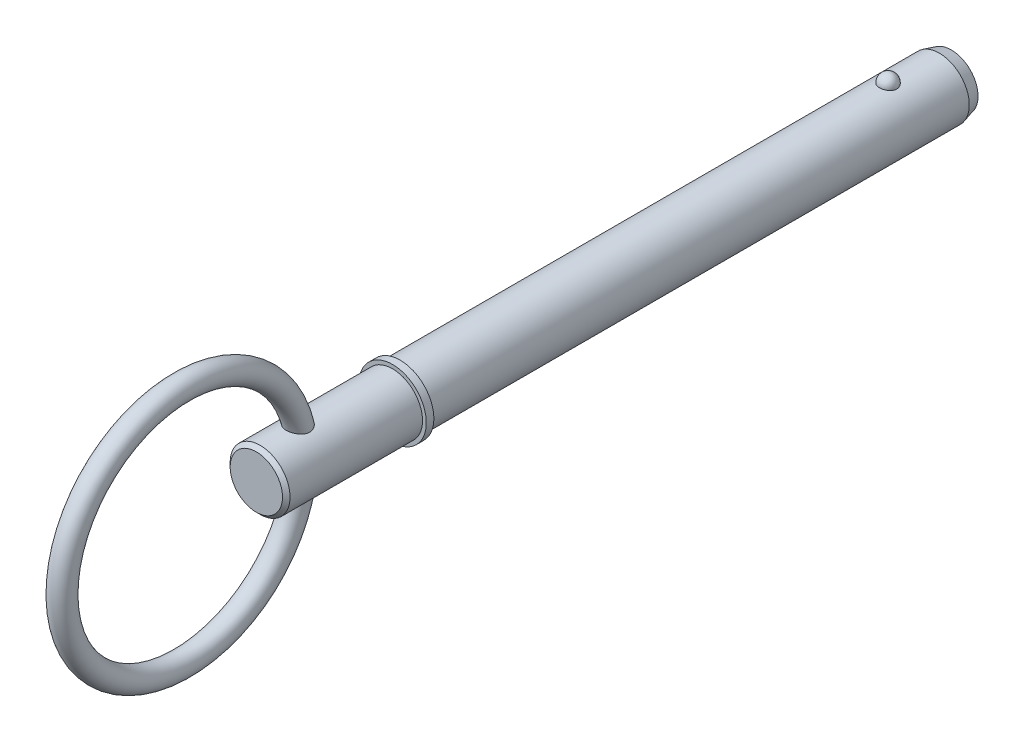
from build123d import *

# Parameters (mm, degrees)
SKETCH2_R           = 3.97
BOSS_EXTRUDE1_DEPTH = 63.5
BOSS_EXTRUDE2_START = 9.53
SKETCH3_R           = 3.97
BOSS_EXTRUDE2_DEPTH = 9.53
CHAMFER1_SIZE       = 1.586
CHAMFER1_SIZE2      = 0.424967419
SKETCH20_W          = 1
SKETCH20_H          = 4.47
SKETCH21_R          = 3.97
BOSS_EXTRUDE3_DEPTH = 19.05
CHAMFER2_SIZE       = 0.5
SKETCH24_R          = 1.5


with BuildPart() as part:
    # Sketch2 → Boss-Extrude1 (new body)
    with BuildSketch(Plane.XY):
        Circle(SKETCH2_R)
    extrude(amount=BOSS_EXTRUDE1_DEPTH)

    # Sketch3 → Boss-Extrude2 (add)
    with BuildSketch(Plane(origin=(0, 0, 0), x_dir=(-1, 0, 0), z_dir=(0, 0, -1)).offset(BOSS_EXTRUDE2_START)):
        Circle(SKETCH3_R)
    extrude(amount=-BOSS_EXTRUDE2_DEPTH)

    # Chamfer1
    chamfer1_edges = [part.edges().sort_by_distance(p)[0] for p in [
        (3.97, 0, -9.53),
    ]]
    chamfer1_side = [part.faces().sort_by_distance(p)[0] for p in [
        (3.97, 0, -4.765),
    ]]
    chamfer(chamfer1_edges, length=CHAMFER1_SIZE, length2=CHAMFER1_SIZE2, reference=chamfer1_side[0])

    # Sketch18 → Revolve1 (revolve)
    with BuildSketch(Plane(origin=(0, 0, 0), x_dir=(0, 0, -1), z_dir=(1, 0, 0))):
        with BuildLine():
            Line((1.15, 5.12), (1.15, 2.82))
            ThreePointArc((1.15, 2.82), (0, 3.97), (1.15, 5.12))
        make_face()
    revolve(axis=Axis((0, 5.12, -1.15), (0, -1, 0)))

    # Sketch20 → Revolve2 (revolve)
    with BuildSketch(Plane(origin=(0, 0, 0), x_dir=(0, 0, -1), z_dir=(1, 0, 0)), mode=Mode.PRIVATE) as revolve2_sk:
        with Locations((-64, 2.235)):
            Rectangle(SKETCH20_W, SKETCH20_H)
    revolve(revolve2_sk.sketch.rotate(Axis((0, 0, 33.728787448), (0, 0, 1)), 90), axis=Axis((0, 0, 33.728787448), (0, 0, 1)))

    # Sketch21 → Boss-Extrude3 (add)
    with BuildSketch(Plane(origin=(0, 0, 63.5), x_dir=(-1, 0, 0), z_dir=(0, 0, -1))):
        Circle(SKETCH21_R)
    extrude(amount=-BOSS_EXTRUDE3_DEPTH)

    # Chamfer2
    chamfer2_edges = [part.edges().sort_by_distance(p)[0] for p in [
        (3.97, 0, 82.55),
    ]]
    chamfer(chamfer2_edges, length=CHAMFER2_SIZE)

    # Sweep1: sweep along a path in Sketch23
    with BuildLine(Plane(origin=(0, 0, 0), x_dir=(0, 0, -1), z_dir=(1, 0, 0))) as sweep1_path:
        CenterArc((-92.425, 0), 15.875, 0, 360)
    # Sketch24 → Sweep1 (sweep)
    with BuildSketch(Plane(origin=(0, 0, 0), x_dir=(1, 0, 0), z_dir=(0, 1, 0))):
        with Locations((0, -76.55)):
            Circle(SKETCH24_R)
    sweep(path=sweep1_path.line)


solid = part.part
